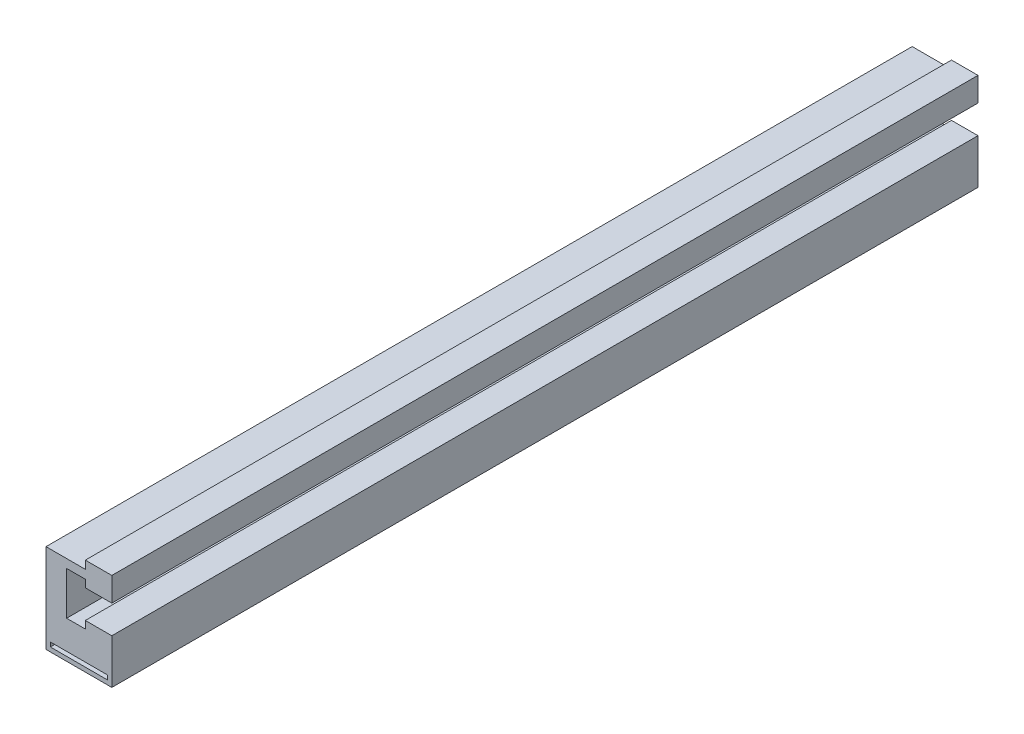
ISO-10303-21;
HEADER;
FILE_DESCRIPTION(('STEP AP214'),'2;1');
FILE_NAME('part.step','',(''),(''),'','','');
FILE_SCHEMA(('AUTOMOTIVE_DESIGN { 1 0 10303 214 1 1 1 1 }'));
ENDSEC;
DATA;
#1=APPLICATION_CONTEXT('core data for automotive mechanical design processes');
#2=APPLICATION_PROTOCOL_DEFINITION('international standard','automotive_design',2000,#1);
#3=PRODUCT_CONTEXT('',#1,'mechanical');
#4=PRODUCT('Part','Part','',(#3));
#5=PRODUCT_RELATED_PRODUCT_CATEGORY('part','',(#4));
#6=PRODUCT_DEFINITION_FORMATION('','',#4);
#7=PRODUCT_DEFINITION_CONTEXT('part definition',#1,'design');
#8=PRODUCT_DEFINITION('design','',#6,#7);
#9=PRODUCT_DEFINITION_SHAPE('','',#8);
#10=(LENGTH_UNIT() NAMED_UNIT(*) SI_UNIT(.MILLI.,.METRE.));
#11=(NAMED_UNIT(*) PLANE_ANGLE_UNIT() SI_UNIT($,.RADIAN.));
#12=(NAMED_UNIT(*) SI_UNIT($,.STERADIAN.) SOLID_ANGLE_UNIT());
#13=UNCERTAINTY_MEASURE_WITH_UNIT(LENGTH_MEASURE(1.E-05),#10,'distance_accuracy_value','');
#14=(GEOMETRIC_REPRESENTATION_CONTEXT(3) GLOBAL_UNCERTAINTY_ASSIGNED_CONTEXT((#13)) GLOBAL_UNIT_ASSIGNED_CONTEXT((#10,
#11,#12)) REPRESENTATION_CONTEXT('',''));
#15=CARTESIAN_POINT('',(0.,0.,0.));
#16=DIRECTION('',(0.,0.,1.));
#17=DIRECTION('',(1.,0.,0.));
#18=AXIS2_PLACEMENT_3D('',#15,#16,#17);
#19=CARTESIAN_POINT('',(19.,51.4,0.));
#20=DIRECTION('',(0.,0.,1.));
#21=DIRECTION('',(1.,0.,0.));
#22=AXIS2_PLACEMENT_3D('',#19,#20,#21);
#23=PLANE('',#22);
#24=DIRECTION('',(0.,1.,0.));
#25=VECTOR('',#24,1.);
#26=CARTESIAN_POINT('',(19.,42.15,0.));
#27=LINE('',#26,#25);
#28=CARTESIAN_POINT('',(19.,42.15,0.));
#29=VERTEX_POINT('',#28);
#30=CARTESIAN_POINT('',(19.,56.,0.));
#31=VERTEX_POINT('',#30);
#32=EDGE_CURVE('E216',#29,#31,#27,.T.);
#33=ORIENTED_EDGE('',*,*,#32,.F.);
#34=DIRECTION('',(-1.,0.,0.));
#35=VECTOR('',#34,1.);
#36=CARTESIAN_POINT('',(19.,42.15,0.));
#37=LINE('',#36,#35);
#38=CARTESIAN_POINT('',(3.70000000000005,42.15,0.));
#39=VERTEX_POINT('',#38);
#40=EDGE_CURVE('E255',#29,#39,#37,.T.);
#41=ORIENTED_EDGE('',*,*,#40,.T.);
#42=DIRECTION('',(0.,-1.,0.));
#43=VECTOR('',#42,1.);
#44=CARTESIAN_POINT('',(3.70000000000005,46.45,0.));
#45=LINE('',#44,#43);
#46=CARTESIAN_POINT('',(3.70000000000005,46.45,0.));
#47=VERTEX_POINT('',#46);
#48=EDGE_CURVE('E252',#47,#39,#45,.T.);
#49=ORIENTED_EDGE('',*,*,#48,.F.);
#50=DIRECTION('',(-1.,0.,0.));
#51=VECTOR('',#50,1.);
#52=CARTESIAN_POINT('',(3.70000000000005,46.45,0.));
#53=LINE('',#52,#51);
#54=CARTESIAN_POINT('',(-7.10000000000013,46.45,0.));
#55=VERTEX_POINT('',#54);
#56=EDGE_CURVE('E249',#47,#55,#53,.T.);
#57=ORIENTED_EDGE('',*,*,#56,.T.);
#58=DIRECTION('',(0.,-1.,0.));
#59=VECTOR('',#58,1.);
#60=CARTESIAN_POINT('',(-7.10000000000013,46.45,0.));
#61=LINE('',#60,#59);
#62=CARTESIAN_POINT('',(-7.1,21.55,0.));
#63=VERTEX_POINT('',#62);
#64=EDGE_CURVE('E246',#55,#63,#61,.T.);
#65=ORIENTED_EDGE('',*,*,#64,.T.);
#66=DIRECTION('',(-1.,0.,0.));
#67=VECTOR('',#66,1.);
#68=CARTESIAN_POINT('',(3.70000000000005,21.55,0.));
#69=LINE('',#68,#67);
#70=CARTESIAN_POINT('',(3.70000000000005,21.55,0.));
#71=VERTEX_POINT('',#70);
#72=EDGE_CURVE('E243',#71,#63,#69,.T.);
#73=ORIENTED_EDGE('',*,*,#72,.F.);
#74=DIRECTION('',(0.,-1.,0.));
#75=VECTOR('',#74,1.);
#76=CARTESIAN_POINT('',(3.70000000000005,25.85,0.));
#77=LINE('',#76,#75);
#78=CARTESIAN_POINT('',(3.70000000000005,25.85,0.));
#79=VERTEX_POINT('',#78);
#80=EDGE_CURVE('E240',#79,#71,#77,.T.);
#81=ORIENTED_EDGE('',*,*,#80,.F.);
#82=DIRECTION('',(-1.,0.,0.));
#83=VECTOR('',#82,1.);
#84=CARTESIAN_POINT('',(19.,25.85,0.));
#85=LINE('',#84,#83);
#86=CARTESIAN_POINT('',(19.,25.85,0.));
#87=VERTEX_POINT('',#86);
#88=EDGE_CURVE('E237',#87,#79,#85,.T.);
#89=ORIENTED_EDGE('',*,*,#88,.F.);
#90=DIRECTION('',(0.,1.,0.));
#91=VECTOR('',#90,1.);
#92=CARTESIAN_POINT('',(19.,0.,0.));
#93=LINE('',#92,#91);
#94=CARTESIAN_POINT('',(19.,0.,0.));
#95=VERTEX_POINT('',#94);
#96=EDGE_CURVE('E234',#95,#87,#93,.T.);
#97=ORIENTED_EDGE('',*,*,#96,.F.);
#98=DIRECTION('',(-1.,0.,0.));
#99=VECTOR('',#98,1.);
#100=CARTESIAN_POINT('',(19.,0.,0.));
#101=LINE('',#100,#99);
#102=CARTESIAN_POINT('',(-19.,0.,0.));
#103=VERTEX_POINT('',#102);
#104=EDGE_CURVE('E231',#95,#103,#101,.T.);
#105=ORIENTED_EDGE('',*,*,#104,.T.);
#106=DIRECTION('',(0.,1.,0.));
#107=VECTOR('',#106,1.);
#108=CARTESIAN_POINT('',(-19.,0.,0.));
#109=LINE('',#108,#107);
#110=CARTESIAN_POINT('',(-19.,51.4,0.));
#111=VERTEX_POINT('',#110);
#112=EDGE_CURVE('E228',#103,#111,#109,.T.);
#113=ORIENTED_EDGE('',*,*,#112,.T.);
#114=DIRECTION('',(-1.,0.,0.));
#115=VECTOR('',#114,1.);
#116=CARTESIAN_POINT('',(3.70000000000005,51.4,0.));
#117=LINE('',#116,#115);
#118=CARTESIAN_POINT('',(3.70000000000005,51.4,0.));
#119=VERTEX_POINT('',#118);
#120=EDGE_CURVE('E225',#119,#111,#117,.T.);
#121=ORIENTED_EDGE('',*,*,#120,.F.);
#122=DIRECTION('',(0.,1.,0.));
#123=VECTOR('',#122,1.);
#124=CARTESIAN_POINT('',(3.70000000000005,51.4,0.));
#125=LINE('',#124,#123);
#126=CARTESIAN_POINT('',(3.70000000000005,56.,0.));
#127=VERTEX_POINT('',#126);
#128=EDGE_CURVE('E222',#119,#127,#125,.T.);
#129=ORIENTED_EDGE('',*,*,#128,.T.);
#130=DIRECTION('',(-1.,0.,0.));
#131=VECTOR('',#130,1.);
#132=CARTESIAN_POINT('',(19.,56.,0.));
#133=LINE('',#132,#131);
#134=EDGE_CURVE('E219',#31,#127,#133,.T.);
#135=ORIENTED_EDGE('',*,*,#134,.F.);
#136=EDGE_LOOP('',(#33,#41,#49,#57,#65,#73,#81,#89,#97,#105,#113,#121,#129,#135));
#137=FACE_BOUND('',#136,.T.);
#138=DIRECTION('',(0.,1.,0.));
#139=VECTOR('',#138,1.);
#140=CARTESIAN_POINT('',(-16.5,2.5,0.));
#141=LINE('',#140,#139);
#142=CARTESIAN_POINT('',(-16.5,2.5,0.));
#143=VERTEX_POINT('',#142);
#144=CARTESIAN_POINT('',(-16.5,4.99999999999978,0.));
#145=VERTEX_POINT('',#144);
#146=EDGE_CURVE('E140',#143,#145,#141,.T.);
#147=ORIENTED_EDGE('',*,*,#146,.F.);
#148=DIRECTION('',(-1.,0.,0.));
#149=VECTOR('',#148,1.);
#150=CARTESIAN_POINT('',(16.5,2.5,0.));
#151=LINE('',#150,#149);
#152=CARTESIAN_POINT('',(16.5,2.5,0.));
#153=VERTEX_POINT('',#152);
#154=EDGE_CURVE('E167',#153,#143,#151,.T.);
#155=ORIENTED_EDGE('',*,*,#154,.F.);
#156=DIRECTION('',(0.,1.,0.));
#157=VECTOR('',#156,1.);
#158=CARTESIAN_POINT('',(16.5,2.5,0.));
#159=LINE('',#158,#157);
#160=CARTESIAN_POINT('',(16.5,5.,0.));
#161=VERTEX_POINT('',#160);
#162=EDGE_CURVE('E29',#153,#161,#159,.T.);
#163=ORIENTED_EDGE('',*,*,#162,.T.);
#164=DIRECTION('',(-1.,0.,0.));
#165=VECTOR('',#164,1.);
#166=CARTESIAN_POINT('',(16.5,5.,0.));
#167=LINE('',#166,#165);
#168=EDGE_CURVE('E164',#161,#145,#167,.T.);
#169=ORIENTED_EDGE('',*,*,#168,.T.);
#170=EDGE_LOOP('',(#147,#155,#163,#169));
#171=FACE_BOUND('',#170,.T.);
#172=ADVANCED_FACE('F14',(#137,#171),#23,.F.);
#173=CARTESIAN_POINT('',(19.,51.4,500.));
#174=DIRECTION('',(0.,0.,1.));
#175=DIRECTION('',(1.,0.,0.));
#176=AXIS2_PLACEMENT_3D('',#173,#174,#175);
#177=PLANE('',#176);
#178=DIRECTION('',(0.,1.,0.));
#179=VECTOR('',#178,1.);
#180=CARTESIAN_POINT('',(19.,42.15,500.));
#181=LINE('',#180,#179);
#182=CARTESIAN_POINT('',(19.,42.15,500.));
#183=VERTEX_POINT('',#182);
#184=CARTESIAN_POINT('',(19.,56.,500.));
#185=VERTEX_POINT('',#184);
#186=EDGE_CURVE('E144',#183,#185,#181,.T.);
#187=ORIENTED_EDGE('',*,*,#186,.T.);
#188=DIRECTION('',(-1.,0.,0.));
#189=VECTOR('',#188,1.);
#190=CARTESIAN_POINT('',(19.,56.,500.));
#191=LINE('',#190,#189);
#192=CARTESIAN_POINT('',(3.70000000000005,56.,500.));
#193=VERTEX_POINT('',#192);
#194=EDGE_CURVE('E177',#185,#193,#191,.T.);
#195=ORIENTED_EDGE('',*,*,#194,.T.);
#196=DIRECTION('',(0.,1.,0.));
#197=VECTOR('',#196,1.);
#198=CARTESIAN_POINT('',(3.70000000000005,51.4,500.));
#199=LINE('',#198,#197);
#200=CARTESIAN_POINT('',(3.70000000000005,51.4,500.));
#201=VERTEX_POINT('',#200);
#202=EDGE_CURVE('E180',#201,#193,#199,.T.);
#203=ORIENTED_EDGE('',*,*,#202,.F.);
#204=DIRECTION('',(-1.,0.,0.));
#205=VECTOR('',#204,1.);
#206=CARTESIAN_POINT('',(3.70000000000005,51.4,500.));
#207=LINE('',#206,#205);
#208=CARTESIAN_POINT('',(-19.,51.4,500.));
#209=VERTEX_POINT('',#208);
#210=EDGE_CURVE('E183',#201,#209,#207,.T.);
#211=ORIENTED_EDGE('',*,*,#210,.T.);
#212=DIRECTION('',(0.,1.,0.));
#213=VECTOR('',#212,1.);
#214=CARTESIAN_POINT('',(-19.,0.,500.));
#215=LINE('',#214,#213);
#216=CARTESIAN_POINT('',(-19.,0.,500.));
#217=VERTEX_POINT('',#216);
#218=EDGE_CURVE('E186',#217,#209,#215,.T.);
#219=ORIENTED_EDGE('',*,*,#218,.F.);
#220=DIRECTION('',(-1.,0.,0.));
#221=VECTOR('',#220,1.);
#222=CARTESIAN_POINT('',(19.,0.,500.));
#223=LINE('',#222,#221);
#224=CARTESIAN_POINT('',(19.,0.,500.));
#225=VERTEX_POINT('',#224);
#226=EDGE_CURVE('E189',#225,#217,#223,.T.);
#227=ORIENTED_EDGE('',*,*,#226,.F.);
#228=DIRECTION('',(0.,1.,0.));
#229=VECTOR('',#228,1.);
#230=CARTESIAN_POINT('',(19.,0.,500.));
#231=LINE('',#230,#229);
#232=CARTESIAN_POINT('',(19.,25.85,500.));
#233=VERTEX_POINT('',#232);
#234=EDGE_CURVE('E192',#225,#233,#231,.T.);
#235=ORIENTED_EDGE('',*,*,#234,.T.);
#236=DIRECTION('',(-1.,0.,0.));
#237=VECTOR('',#236,1.);
#238=CARTESIAN_POINT('',(19.,25.85,500.));
#239=LINE('',#238,#237);
#240=CARTESIAN_POINT('',(3.70000000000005,25.85,500.));
#241=VERTEX_POINT('',#240);
#242=EDGE_CURVE('E195',#233,#241,#239,.T.);
#243=ORIENTED_EDGE('',*,*,#242,.T.);
#244=DIRECTION('',(0.,-1.,0.));
#245=VECTOR('',#244,1.);
#246=CARTESIAN_POINT('',(3.70000000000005,25.85,500.));
#247=LINE('',#246,#245);
#248=CARTESIAN_POINT('',(3.70000000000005,21.55,500.));
#249=VERTEX_POINT('',#248);
#250=EDGE_CURVE('E198',#241,#249,#247,.T.);
#251=ORIENTED_EDGE('',*,*,#250,.T.);
#252=DIRECTION('',(-1.,0.,0.));
#253=VECTOR('',#252,1.);
#254=CARTESIAN_POINT('',(3.70000000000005,21.55,500.));
#255=LINE('',#254,#253);
#256=CARTESIAN_POINT('',(-7.1,21.55,500.));
#257=VERTEX_POINT('',#256);
#258=EDGE_CURVE('E201',#249,#257,#255,.T.);
#259=ORIENTED_EDGE('',*,*,#258,.T.);
#260=DIRECTION('',(0.,-1.,0.));
#261=VECTOR('',#260,1.);
#262=CARTESIAN_POINT('',(-7.10000000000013,46.45,500.));
#263=LINE('',#262,#261);
#264=CARTESIAN_POINT('',(-7.10000000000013,46.45,500.));
#265=VERTEX_POINT('',#264);
#266=EDGE_CURVE('E204',#265,#257,#263,.T.);
#267=ORIENTED_EDGE('',*,*,#266,.F.);
#268=DIRECTION('',(-1.,0.,0.));
#269=VECTOR('',#268,1.);
#270=CARTESIAN_POINT('',(3.70000000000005,46.45,500.));
#271=LINE('',#270,#269);
#272=CARTESIAN_POINT('',(3.70000000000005,46.45,500.));
#273=VERTEX_POINT('',#272);
#274=EDGE_CURVE('E207',#273,#265,#271,.T.);
#275=ORIENTED_EDGE('',*,*,#274,.F.);
#276=DIRECTION('',(0.,-1.,0.));
#277=VECTOR('',#276,1.);
#278=CARTESIAN_POINT('',(3.70000000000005,46.45,500.));
#279=LINE('',#278,#277);
#280=CARTESIAN_POINT('',(3.70000000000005,42.15,500.));
#281=VERTEX_POINT('',#280);
#282=EDGE_CURVE('E210',#273,#281,#279,.T.);
#283=ORIENTED_EDGE('',*,*,#282,.T.);
#284=DIRECTION('',(-1.,0.,0.));
#285=VECTOR('',#284,1.);
#286=CARTESIAN_POINT('',(19.,42.15,500.));
#287=LINE('',#286,#285);
#288=EDGE_CURVE('E213',#183,#281,#287,.T.);
#289=ORIENTED_EDGE('',*,*,#288,.F.);
#290=EDGE_LOOP('',(#187,#195,#203,#211,#219,#227,#235,#243,#251,#259,#267,#275,#283,#289));
#291=FACE_BOUND('',#290,.T.);
#292=DIRECTION('',(-1.,0.,0.));
#293=VECTOR('',#292,1.);
#294=CARTESIAN_POINT('',(16.5,2.5,500.));
#295=LINE('',#294,#293);
#296=CARTESIAN_POINT('',(16.5,2.5,500.));
#297=VERTEX_POINT('',#296);
#298=CARTESIAN_POINT('',(-16.5,2.5,500.));
#299=VERTEX_POINT('',#298);
#300=EDGE_CURVE('E158',#297,#299,#295,.T.);
#301=ORIENTED_EDGE('',*,*,#300,.T.);
#302=DIRECTION('',(0.,1.,0.));
#303=VECTOR('',#302,1.);
#304=CARTESIAN_POINT('',(-16.5,2.5,500.));
#305=LINE('',#304,#303);
#306=CARTESIAN_POINT('',(-16.5,4.99999999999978,500.));
#307=VERTEX_POINT('',#306);
#308=EDGE_CURVE('E37',#299,#307,#305,.T.);
#309=ORIENTED_EDGE('',*,*,#308,.T.);
#310=DIRECTION('',(-1.,0.,0.));
#311=VECTOR('',#310,1.);
#312=CARTESIAN_POINT('',(16.5,5.,500.));
#313=LINE('',#312,#311);
#314=CARTESIAN_POINT('',(16.5,5.,500.));
#315=VERTEX_POINT('',#314);
#316=EDGE_CURVE('E148',#315,#307,#313,.T.);
#317=ORIENTED_EDGE('',*,*,#316,.F.);
#318=DIRECTION('',(0.,1.,0.));
#319=VECTOR('',#318,1.);
#320=CARTESIAN_POINT('',(16.5,2.5,500.));
#321=LINE('',#320,#319);
#322=EDGE_CURVE('E153',#297,#315,#321,.T.);
#323=ORIENTED_EDGE('',*,*,#322,.F.);
#324=EDGE_LOOP('',(#301,#309,#317,#323));
#325=FACE_BOUND('',#324,.T.);
#326=ADVANCED_FACE('F156',(#291,#325),#177,.T.);
#327=CARTESIAN_POINT('',(19.,42.15,0.));
#328=DIRECTION('',(1.,0.,0.));
#329=DIRECTION('',(0.,0.,-1.));
#330=AXIS2_PLACEMENT_3D('',#327,#328,#329);
#331=PLANE('',#330);
#332=DIRECTION('',(0.,0.,1.));
#333=VECTOR('',#332,1.);
#334=CARTESIAN_POINT('',(19.,42.15,0.));
#335=LINE('',#334,#333);
#336=EDGE_CURVE('E9',#29,#183,#335,.T.);
#337=ORIENTED_EDGE('',*,*,#336,.F.);
#338=ORIENTED_EDGE('',*,*,#32,.T.);
#339=DIRECTION('',(0.,0.,1.));
#340=VECTOR('',#339,1.);
#341=CARTESIAN_POINT('',(19.,56.,0.));
#342=LINE('',#341,#340);
#343=EDGE_CURVE('E258',#31,#185,#342,.T.);
#344=ORIENTED_EDGE('',*,*,#343,.T.);
#345=ORIENTED_EDGE('',*,*,#186,.F.);
#346=EDGE_LOOP('',(#337,#338,#344,#345));
#347=FACE_BOUND('',#346,.T.);
#348=ADVANCED_FACE('F294',(#347),#331,.T.);
#349=CARTESIAN_POINT('',(19.,42.15,0.));
#350=DIRECTION('',(0.,1.,0.));
#351=DIRECTION('',(1.,0.,0.));
#352=AXIS2_PLACEMENT_3D('',#349,#350,#351);
#353=PLANE('',#352);
#354=DIRECTION('',(0.,0.,1.));
#355=VECTOR('',#354,1.);
#356=CARTESIAN_POINT('',(3.70000000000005,42.15,0.));
#357=LINE('',#356,#355);
#358=EDGE_CURVE('E22',#39,#281,#357,.T.);
#359=ORIENTED_EDGE('',*,*,#358,.F.);
#360=ORIENTED_EDGE('',*,*,#40,.F.);
#361=ORIENTED_EDGE('',*,*,#336,.T.);
#362=ORIENTED_EDGE('',*,*,#288,.T.);
#363=EDGE_LOOP('',(#359,#360,#361,#362));
#364=FACE_BOUND('',#363,.T.);
#365=ADVANCED_FACE('F16',(#364),#353,.F.);
#366=CARTESIAN_POINT('',(3.70000000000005,46.45,0.));
#367=DIRECTION('',(-1.,0.,0.));
#368=DIRECTION('',(0.,0.,1.));
#369=AXIS2_PLACEMENT_3D('',#366,#367,#368);
#370=PLANE('',#369);
#371=DIRECTION('',(0.,0.,1.));
#372=VECTOR('',#371,1.);
#373=CARTESIAN_POINT('',(3.70000000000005,46.45,0.));
#374=LINE('',#373,#372);
#375=EDGE_CURVE('E280',#47,#273,#374,.T.);
#376=ORIENTED_EDGE('',*,*,#375,.F.);
#377=ORIENTED_EDGE('',*,*,#48,.T.);
#378=ORIENTED_EDGE('',*,*,#358,.T.);
#379=ORIENTED_EDGE('',*,*,#282,.F.);
#380=EDGE_LOOP('',(#376,#377,#378,#379));
#381=FACE_BOUND('',#380,.T.);
#382=ADVANCED_FACE('F283',(#381),#370,.T.);
#383=CARTESIAN_POINT('',(3.70000000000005,46.45,0.));
#384=DIRECTION('',(0.,1.,0.));
#385=DIRECTION('',(1.,0.,0.));
#386=AXIS2_PLACEMENT_3D('',#383,#384,#385);
#387=PLANE('',#386);
#388=DIRECTION('',(0.,0.,1.));
#389=VECTOR('',#388,1.);
#390=CARTESIAN_POINT('',(-7.10000000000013,46.45,0.));
#391=LINE('',#390,#389);
#392=EDGE_CURVE('E278',#55,#265,#391,.T.);
#393=ORIENTED_EDGE('',*,*,#392,.F.);
#394=ORIENTED_EDGE('',*,*,#56,.F.);
#395=ORIENTED_EDGE('',*,*,#375,.T.);
#396=ORIENTED_EDGE('',*,*,#274,.T.);
#397=EDGE_LOOP('',(#393,#394,#395,#396));
#398=FACE_BOUND('',#397,.T.);
#399=ADVANCED_FACE('F335',(#398),#387,.F.);
#400=CARTESIAN_POINT('',(-7.10000000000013,46.45,0.));
#401=DIRECTION('',(-1.,0.,0.));
#402=DIRECTION('',(0.,1.,0.));
#403=AXIS2_PLACEMENT_3D('',#400,#401,#402);
#404=PLANE('',#403);
#405=DIRECTION('',(0.,0.,1.));
#406=VECTOR('',#405,1.);
#407=CARTESIAN_POINT('',(-7.1,21.55,0.));
#408=LINE('',#407,#406);
#409=EDGE_CURVE('E276',#63,#257,#408,.T.);
#410=ORIENTED_EDGE('',*,*,#409,.F.);
#411=ORIENTED_EDGE('',*,*,#64,.F.);
#412=ORIENTED_EDGE('',*,*,#392,.T.);
#413=ORIENTED_EDGE('',*,*,#266,.T.);
#414=EDGE_LOOP('',(#410,#411,#412,#413));
#415=FACE_BOUND('',#414,.T.);
#416=ADVANCED_FACE('F333',(#415),#404,.F.);
#417=CARTESIAN_POINT('',(3.70000000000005,21.55,0.));
#418=DIRECTION('',(0.,1.,0.));
#419=DIRECTION('',(0.,0.,-1.));
#420=AXIS2_PLACEMENT_3D('',#417,#418,#419);
#421=PLANE('',#420);
#422=DIRECTION('',(0.,0.,1.));
#423=VECTOR('',#422,1.);
#424=CARTESIAN_POINT('',(3.70000000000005,21.55,0.));
#425=LINE('',#424,#423);
#426=EDGE_CURVE('E274',#71,#249,#425,.T.);
#427=ORIENTED_EDGE('',*,*,#426,.F.);
#428=ORIENTED_EDGE('',*,*,#72,.T.);
#429=ORIENTED_EDGE('',*,*,#409,.T.);
#430=ORIENTED_EDGE('',*,*,#258,.F.);
#431=EDGE_LOOP('',(#427,#428,#429,#430));
#432=FACE_BOUND('',#431,.T.);
#433=ADVANCED_FACE('F330',(#432),#421,.T.);
#434=CARTESIAN_POINT('',(3.70000000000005,25.85,0.));
#435=DIRECTION('',(-1.,0.,0.));
#436=DIRECTION('',(0.,0.,1.));
#437=AXIS2_PLACEMENT_3D('',#434,#435,#436);
#438=PLANE('',#437);
#439=DIRECTION('',(0.,0.,1.));
#440=VECTOR('',#439,1.);
#441=CARTESIAN_POINT('',(3.70000000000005,25.85,0.));
#442=LINE('',#441,#440);
#443=EDGE_CURVE('E272',#79,#241,#442,.T.);
#444=ORIENTED_EDGE('',*,*,#443,.F.);
#445=ORIENTED_EDGE('',*,*,#80,.T.);
#446=ORIENTED_EDGE('',*,*,#426,.T.);
#447=ORIENTED_EDGE('',*,*,#250,.F.);
#448=EDGE_LOOP('',(#444,#445,#446,#447));
#449=FACE_BOUND('',#448,.T.);
#450=ADVANCED_FACE('F326',(#449),#438,.T.);
#451=CARTESIAN_POINT('',(19.,25.85,0.));
#452=DIRECTION('',(0.,1.,0.));
#453=DIRECTION('',(0.,0.,-1.));
#454=AXIS2_PLACEMENT_3D('',#451,#452,#453);
#455=PLANE('',#454);
#456=DIRECTION('',(0.,0.,1.));
#457=VECTOR('',#456,1.);
#458=CARTESIAN_POINT('',(19.,25.85,0.));
#459=LINE('',#458,#457);
#460=EDGE_CURVE('E270',#87,#233,#459,.T.);
#461=ORIENTED_EDGE('',*,*,#460,.F.);
#462=ORIENTED_EDGE('',*,*,#88,.T.);
#463=ORIENTED_EDGE('',*,*,#443,.T.);
#464=ORIENTED_EDGE('',*,*,#242,.F.);
#465=EDGE_LOOP('',(#461,#462,#463,#464));
#466=FACE_BOUND('',#465,.T.);
#467=ADVANCED_FACE('F323',(#466),#455,.T.);
#468=CARTESIAN_POINT('',(19.,0.,0.));
#469=DIRECTION('',(1.,0.,0.));
#470=DIRECTION('',(0.,0.,-1.));
#471=AXIS2_PLACEMENT_3D('',#468,#469,#470);
#472=PLANE('',#471);
#473=DIRECTION('',(0.,0.,1.));
#474=VECTOR('',#473,1.);
#475=CARTESIAN_POINT('',(19.,0.,0.));
#476=LINE('',#475,#474);
#477=EDGE_CURVE('E268',#95,#225,#476,.T.);
#478=ORIENTED_EDGE('',*,*,#477,.F.);
#479=ORIENTED_EDGE('',*,*,#96,.T.);
#480=ORIENTED_EDGE('',*,*,#460,.T.);
#481=ORIENTED_EDGE('',*,*,#234,.F.);
#482=EDGE_LOOP('',(#478,#479,#480,#481));
#483=FACE_BOUND('',#482,.T.);
#484=ADVANCED_FACE('F318',(#483),#472,.T.);
#485=CARTESIAN_POINT('',(19.,0.,0.));
#486=DIRECTION('',(0.,1.,0.));
#487=DIRECTION('',(0.,0.,-1.));
#488=AXIS2_PLACEMENT_3D('',#485,#486,#487);
#489=PLANE('',#488);
#490=DIRECTION('',(0.,0.,1.));
#491=VECTOR('',#490,1.);
#492=CARTESIAN_POINT('',(-19.,0.,0.));
#493=LINE('',#492,#491);
#494=EDGE_CURVE('E266',#103,#217,#493,.T.);
#495=ORIENTED_EDGE('',*,*,#494,.F.);
#496=ORIENTED_EDGE('',*,*,#104,.F.);
#497=ORIENTED_EDGE('',*,*,#477,.T.);
#498=ORIENTED_EDGE('',*,*,#226,.T.);
#499=EDGE_LOOP('',(#495,#496,#497,#498));
#500=FACE_BOUND('',#499,.T.);
#501=ADVANCED_FACE('F314',(#500),#489,.F.);
#502=CARTESIAN_POINT('',(-19.,0.,0.));
#503=DIRECTION('',(1.,0.,0.));
#504=DIRECTION('',(0.,-1.,0.));
#505=AXIS2_PLACEMENT_3D('',#502,#503,#504);
#506=PLANE('',#505);
#507=DIRECTION('',(0.,0.,1.));
#508=VECTOR('',#507,1.);
#509=CARTESIAN_POINT('',(-19.,51.4,0.));
#510=LINE('',#509,#508);
#511=EDGE_CURVE('E264',#111,#209,#510,.T.);
#512=ORIENTED_EDGE('',*,*,#511,.F.);
#513=ORIENTED_EDGE('',*,*,#112,.F.);
#514=ORIENTED_EDGE('',*,*,#494,.T.);
#515=ORIENTED_EDGE('',*,*,#218,.T.);
#516=EDGE_LOOP('',(#512,#513,#514,#515));
#517=FACE_BOUND('',#516,.T.);
#518=ADVANCED_FACE('F310',(#517),#506,.F.);
#519=CARTESIAN_POINT('',(3.70000000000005,51.4,0.));
#520=DIRECTION('',(0.,1.,0.));
#521=DIRECTION('',(0.,0.,-1.));
#522=AXIS2_PLACEMENT_3D('',#519,#520,#521);
#523=PLANE('',#522);
#524=DIRECTION('',(0.,0.,1.));
#525=VECTOR('',#524,1.);
#526=CARTESIAN_POINT('',(3.70000000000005,51.4,0.));
#527=LINE('',#526,#525);
#528=EDGE_CURVE('E262',#119,#201,#527,.T.);
#529=ORIENTED_EDGE('',*,*,#528,.F.);
#530=ORIENTED_EDGE('',*,*,#120,.T.);
#531=ORIENTED_EDGE('',*,*,#511,.T.);
#532=ORIENTED_EDGE('',*,*,#210,.F.);
#533=EDGE_LOOP('',(#529,#530,#531,#532));
#534=FACE_BOUND('',#533,.T.);
#535=ADVANCED_FACE('F307',(#534),#523,.T.);
#536=CARTESIAN_POINT('',(3.70000000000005,51.4,0.));
#537=DIRECTION('',(1.,0.,0.));
#538=DIRECTION('',(0.,0.,-1.));
#539=AXIS2_PLACEMENT_3D('',#536,#537,#538);
#540=PLANE('',#539);
#541=DIRECTION('',(0.,0.,1.));
#542=VECTOR('',#541,1.);
#543=CARTESIAN_POINT('',(3.70000000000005,56.,0.));
#544=LINE('',#543,#542);
#545=EDGE_CURVE('E260',#127,#193,#544,.T.);
#546=ORIENTED_EDGE('',*,*,#545,.F.);
#547=ORIENTED_EDGE('',*,*,#128,.F.);
#548=ORIENTED_EDGE('',*,*,#528,.T.);
#549=ORIENTED_EDGE('',*,*,#202,.T.);
#550=EDGE_LOOP('',(#546,#547,#548,#549));
#551=FACE_BOUND('',#550,.T.);
#552=ADVANCED_FACE('F302',(#551),#540,.F.);
#553=CARTESIAN_POINT('',(19.,56.,0.));
#554=DIRECTION('',(0.,1.,0.));
#555=DIRECTION('',(1.,0.,0.));
#556=AXIS2_PLACEMENT_3D('',#553,#554,#555);
#557=PLANE('',#556);
#558=ORIENTED_EDGE('',*,*,#134,.T.);
#559=ORIENTED_EDGE('',*,*,#545,.T.);
#560=ORIENTED_EDGE('',*,*,#194,.F.);
#561=ORIENTED_EDGE('',*,*,#343,.F.);
#562=EDGE_LOOP('',(#558,#559,#560,#561));
#563=FACE_BOUND('',#562,.T.);
#564=ADVANCED_FACE('F298',(#563),#557,.T.);
#565=CARTESIAN_POINT('',(-16.5,2.5,0.));
#566=DIRECTION('',(1.,0.,0.));
#567=DIRECTION('',(0.,0.,-1.));
#568=AXIS2_PLACEMENT_3D('',#565,#566,#567);
#569=PLANE('',#568);
#570=DIRECTION('',(0.,0.,1.));
#571=VECTOR('',#570,1.);
#572=CARTESIAN_POINT('',(-16.5,4.99999999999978,0.));
#573=LINE('',#572,#571);
#574=EDGE_CURVE('E136',#145,#307,#573,.T.);
#575=ORIENTED_EDGE('',*,*,#574,.T.);
#576=ORIENTED_EDGE('',*,*,#308,.F.);
#577=DIRECTION('',(0.,0.,1.));
#578=VECTOR('',#577,1.);
#579=CARTESIAN_POINT('',(-16.5,2.5,0.));
#580=LINE('',#579,#578);
#581=EDGE_CURVE('E170',#143,#299,#580,.T.);
#582=ORIENTED_EDGE('',*,*,#581,.F.);
#583=ORIENTED_EDGE('',*,*,#146,.T.);
#584=EDGE_LOOP('',(#575,#576,#582,#583));
#585=FACE_BOUND('',#584,.T.);
#586=ADVANCED_FACE('F138',(#585),#569,.T.);
#587=CARTESIAN_POINT('',(16.5,5.,0.));
#588=DIRECTION('',(0.,1.,0.));
#589=DIRECTION('',(1.,0.,0.));
#590=AXIS2_PLACEMENT_3D('',#587,#588,#589);
#591=PLANE('',#590);
#592=DIRECTION('',(0.,0.,1.));
#593=VECTOR('',#592,1.);
#594=CARTESIAN_POINT('',(16.5,5.,0.));
#595=LINE('',#594,#593);
#596=EDGE_CURVE('E145',#161,#315,#595,.T.);
#597=ORIENTED_EDGE('',*,*,#596,.T.);
#598=ORIENTED_EDGE('',*,*,#316,.T.);
#599=ORIENTED_EDGE('',*,*,#574,.F.);
#600=ORIENTED_EDGE('',*,*,#168,.F.);
#601=EDGE_LOOP('',(#597,#598,#599,#600));
#602=FACE_BOUND('',#601,.T.);
#603=ADVANCED_FACE('F149',(#602),#591,.F.);
#604=CARTESIAN_POINT('',(16.5,2.5,0.));
#605=DIRECTION('',(1.,0.,0.));
#606=DIRECTION('',(0.,0.,-1.));
#607=AXIS2_PLACEMENT_3D('',#604,#605,#606);
#608=PLANE('',#607);
#609=DIRECTION('',(0.,0.,1.));
#610=VECTOR('',#609,1.);
#611=CARTESIAN_POINT('',(16.5,2.5,0.));
#612=LINE('',#611,#610);
#613=EDGE_CURVE('E172',#153,#297,#612,.T.);
#614=ORIENTED_EDGE('',*,*,#613,.T.);
#615=ORIENTED_EDGE('',*,*,#322,.T.);
#616=ORIENTED_EDGE('',*,*,#596,.F.);
#617=ORIENTED_EDGE('',*,*,#162,.F.);
#618=EDGE_LOOP('',(#614,#615,#616,#617));
#619=FACE_BOUND('',#618,.T.);
#620=ADVANCED_FACE('F344',(#619),#608,.F.);
#621=CARTESIAN_POINT('',(16.5,2.5,0.));
#622=DIRECTION('',(0.,1.,0.));
#623=DIRECTION('',(0.,0.,-1.));
#624=AXIS2_PLACEMENT_3D('',#621,#622,#623);
#625=PLANE('',#624);
#626=ORIENTED_EDGE('',*,*,#154,.T.);
#627=ORIENTED_EDGE('',*,*,#581,.T.);
#628=ORIENTED_EDGE('',*,*,#300,.F.);
#629=ORIENTED_EDGE('',*,*,#613,.F.);
#630=EDGE_LOOP('',(#626,#627,#628,#629));
#631=FACE_BOUND('',#630,.T.);
#632=ADVANCED_FACE('F343',(#631),#625,.T.);
#633=CLOSED_SHELL('',(#172,#326,#348,#365,#382,#399,#416,#433,#450,#467,#484,#501,#518,#535,
#552,#564,#586,#603,#620,#632));
#634=MANIFOLD_SOLID_BREP('B1',#633);
#635=ADVANCED_BREP_SHAPE_REPRESENTATION('',(#18,#634),#14);
#636=SHAPE_DEFINITION_REPRESENTATION(#9,#635);
ENDSEC;
END-ISO-10303-21;
